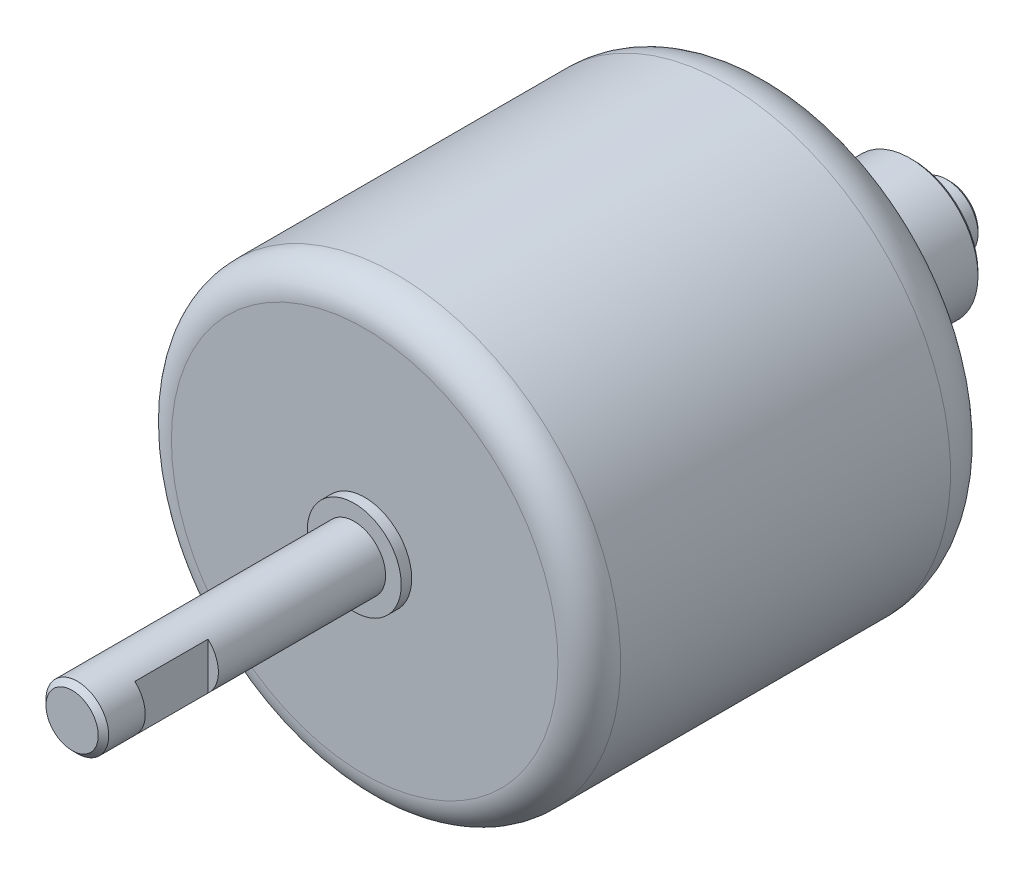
ISO-10303-21;
HEADER;
FILE_DESCRIPTION(('STEP AP214'),'2;1');
FILE_NAME('part.step','',(''),(''),'','','');
FILE_SCHEMA(('AUTOMOTIVE_DESIGN { 1 0 10303 214 1 1 1 1 }'));
ENDSEC;
DATA;
#1=APPLICATION_CONTEXT('core data for automotive mechanical design processes');
#2=APPLICATION_PROTOCOL_DEFINITION('international standard','automotive_design',2000,#1);
#3=PRODUCT_CONTEXT('',#1,'mechanical');
#4=PRODUCT('Part','Part','',(#3));
#5=PRODUCT_RELATED_PRODUCT_CATEGORY('part','',(#4));
#6=PRODUCT_DEFINITION_FORMATION('','',#4);
#7=PRODUCT_DEFINITION_CONTEXT('part definition',#1,'design');
#8=PRODUCT_DEFINITION('design','',#6,#7);
#9=PRODUCT_DEFINITION_SHAPE('','',#8);
#10=(LENGTH_UNIT() NAMED_UNIT(*) SI_UNIT(.MILLI.,.METRE.));
#11=(NAMED_UNIT(*) PLANE_ANGLE_UNIT() SI_UNIT($,.RADIAN.));
#12=(NAMED_UNIT(*) SI_UNIT($,.STERADIAN.) SOLID_ANGLE_UNIT());
#13=UNCERTAINTY_MEASURE_WITH_UNIT(LENGTH_MEASURE(1.E-05),#10,'distance_accuracy_value','');
#14=(GEOMETRIC_REPRESENTATION_CONTEXT(3) GLOBAL_UNCERTAINTY_ASSIGNED_CONTEXT((#13)) GLOBAL_UNIT_ASSIGNED_CONTEXT((#10,
#11,#12)) REPRESENTATION_CONTEXT('',''));
#15=CARTESIAN_POINT('',(0.,0.,0.));
#16=DIRECTION('',(0.,0.,1.));
#17=DIRECTION('',(1.,0.,0.));
#18=AXIS2_PLACEMENT_3D('',#15,#16,#17);
#19=CARTESIAN_POINT('',(0.,3.,0.));
#20=DIRECTION('',(0.,0.,1.));
#21=DIRECTION('',(1.,0.,0.));
#22=AXIS2_PLACEMENT_3D('',#19,#20,#21);
#23=PLANE('',#22);
#24=CARTESIAN_POINT('',(0.,0.,0.));
#25=DIRECTION('',(0.,0.,1.));
#26=DIRECTION('',(1.,0.,0.));
#27=AXIS2_PLACEMENT_3D('',#24,#25,#26);
#28=CIRCLE('',#27,2.7);
#29=CARTESIAN_POINT('',(2.7,0.,0.));
#30=VERTEX_POINT('',#29);
#31=EDGE_CURVE('E11',#30,#30,#28,.F.);
#32=ORIENTED_EDGE('',*,*,#31,.T.);
#33=EDGE_LOOP('',(#32));
#34=FACE_BOUND('',#33,.T.);
#35=ADVANCED_FACE('F35',(#34),#23,.F.);
#36=CARTESIAN_POINT('',(0.,0.,84.));
#37=DIRECTION('',(0.,0.,1.));
#38=DIRECTION('',(1.,0.,0.));
#39=AXIS2_PLACEMENT_3D('',#36,#37,#38);
#40=CYLINDRICAL_SURFACE('',#39,3.);
#41=CARTESIAN_POINT('',(0.,0.,0.299999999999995));
#42=DIRECTION('',(0.,0.,1.));
#43=DIRECTION('',(1.,0.,0.));
#44=AXIS2_PLACEMENT_3D('',#41,#42,#43);
#45=CIRCLE('',#44,3.);
#46=CARTESIAN_POINT('',(3.,0.,0.299999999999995));
#47=VERTEX_POINT('',#46);
#48=EDGE_CURVE('E42',#47,#47,#45,.T.);
#49=ORIENTED_EDGE('',*,*,#48,.T.);
#50=EDGE_LOOP('',(#49));
#51=FACE_BOUND('',#50,.T.);
#52=CARTESIAN_POINT('',(0.,0.,3.5));
#53=DIRECTION('',(0.,0.,1.));
#54=DIRECTION('',(1.,0.,0.));
#55=AXIS2_PLACEMENT_3D('',#52,#53,#54);
#56=CIRCLE('',#55,3.);
#57=CARTESIAN_POINT('',(3.,0.,3.5));
#58=VERTEX_POINT('',#57);
#59=EDGE_CURVE('E230',#58,#58,#56,.T.);
#60=ORIENTED_EDGE('',*,*,#59,.F.);
#61=EDGE_LOOP('',(#60));
#62=FACE_BOUND('',#61,.T.);
#63=ADVANCED_FACE('F122',(#51,#62),#40,.T.);
#64=CARTESIAN_POINT('',(0.,3.,3.5));
#65=DIRECTION('',(0.,0.,1.));
#66=DIRECTION('',(1.,0.,0.));
#67=AXIS2_PLACEMENT_3D('',#64,#65,#66);
#68=PLANE('',#67);
#69=CARTESIAN_POINT('',(0.,0.,3.5));
#70=DIRECTION('',(0.,0.,1.));
#71=DIRECTION('',(1.,0.,0.));
#72=AXIS2_PLACEMENT_3D('',#69,#70,#71);
#73=CIRCLE('',#72,6.19999999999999);
#74=CARTESIAN_POINT('',(6.19999999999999,0.,3.5));
#75=VERTEX_POINT('',#74);
#76=EDGE_CURVE('E117',#75,#75,#73,.F.);
#77=ORIENTED_EDGE('',*,*,#76,.T.);
#78=EDGE_LOOP('',(#77));
#79=FACE_BOUND('',#78,.T.);
#80=ORIENTED_EDGE('',*,*,#59,.T.);
#81=EDGE_LOOP('',(#80));
#82=FACE_BOUND('',#81,.T.);
#83=ADVANCED_FACE('F142',(#79,#82),#68,.F.);
#84=CARTESIAN_POINT('',(0.,0.,84.));
#85=DIRECTION('',(0.,0.,1.));
#86=DIRECTION('',(1.,0.,0.));
#87=AXIS2_PLACEMENT_3D('',#84,#85,#86);
#88=CYLINDRICAL_SURFACE('',#87,6.5);
#89=CARTESIAN_POINT('',(0.,0.,3.8));
#90=DIRECTION('',(0.,0.,1.));
#91=DIRECTION('',(1.,0.,0.));
#92=AXIS2_PLACEMENT_3D('',#89,#90,#91);
#93=CIRCLE('',#92,6.5);
#94=CARTESIAN_POINT('',(6.5,0.,3.8));
#95=VERTEX_POINT('',#94);
#96=EDGE_CURVE('E114',#95,#95,#93,.T.);
#97=ORIENTED_EDGE('',*,*,#96,.T.);
#98=EDGE_LOOP('',(#97));
#99=FACE_BOUND('',#98,.T.);
#100=CARTESIAN_POINT('',(0.,0.,14.5));
#101=DIRECTION('',(0.,0.,1.));
#102=DIRECTION('',(1.,0.,0.));
#103=AXIS2_PLACEMENT_3D('',#100,#101,#102);
#104=CIRCLE('',#103,6.5);
#105=CARTESIAN_POINT('',(6.5,0.,14.5));
#106=VERTEX_POINT('',#105);
#107=EDGE_CURVE('E226',#106,#106,#104,.T.);
#108=ORIENTED_EDGE('',*,*,#107,.F.);
#109=EDGE_LOOP('',(#108));
#110=FACE_BOUND('',#109,.T.);
#111=ADVANCED_FACE('F146',(#99,#110),#88,.T.);
#112=CARTESIAN_POINT('',(0.,6.5,14.5));
#113=DIRECTION('',(0.,0.,1.));
#114=DIRECTION('',(1.,0.,0.));
#115=AXIS2_PLACEMENT_3D('',#112,#113,#114);
#116=PLANE('',#115);
#117=CARTESIAN_POINT('',(0.,0.,14.5));
#118=DIRECTION('',(0.,0.,1.));
#119=DIRECTION('',(1.,0.,0.));
#120=AXIS2_PLACEMENT_3D('',#117,#118,#119);
#121=CIRCLE('',#120,13.1602540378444);
#122=CARTESIAN_POINT('',(13.1602540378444,0.,14.5));
#123=VERTEX_POINT('',#122);
#124=EDGE_CURVE('E102',#123,#123,#121,.F.);
#125=ORIENTED_EDGE('',*,*,#124,.T.);
#126=EDGE_LOOP('',(#125));
#127=FACE_BOUND('',#126,.T.);
#128=ORIENTED_EDGE('',*,*,#107,.T.);
#129=EDGE_LOOP('',(#128));
#130=FACE_BOUND('',#129,.T.);
#131=ADVANCED_FACE('F152',(#127,#130),#116,.F.);
#132=CARTESIAN_POINT('',(0.,0.,14.5));
#133=DIRECTION('',(0.,0.,1.));
#134=DIRECTION('',(1.,0.,0.));
#135=AXIS2_PLACEMENT_3D('',#132,#133,#134);
#136=CONICAL_SURFACE('',#135,14.5,1.0471975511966);
#137=CARTESIAN_POINT('',(0.,0.,15.1698729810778));
#138=DIRECTION('',(0.,0.,-1.));
#139=DIRECTION('',(-1.,0.,0.));
#140=AXIS2_PLACEMENT_3D('',#137,#138,#139);
#141=CIRCLE('',#140,15.6602540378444);
#142=CARTESIAN_POINT('',(-15.6602540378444,0.,15.1698729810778));
#143=VERTEX_POINT('',#142);
#144=EDGE_CURVE('E95',#143,#143,#141,.F.);
#145=ORIENTED_EDGE('',*,*,#144,.T.);
#146=EDGE_LOOP('',(#145));
#147=FACE_BOUND('',#146,.T.);
#148=CARTESIAN_POINT('',(0.,0.,17.0980762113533));
#149=DIRECTION('',(0.,0.,-1.));
#150=DIRECTION('',(-1.,0.,0.));
#151=AXIS2_PLACEMENT_3D('',#148,#149,#150);
#152=CIRCLE('',#151,19.);
#153=CARTESIAN_POINT('',(-19.,0.,17.0980762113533));
#154=VERTEX_POINT('',#153);
#155=EDGE_CURVE('E92',#154,#154,#152,.T.);
#156=ORIENTED_EDGE('',*,*,#155,.T.);
#157=EDGE_LOOP('',(#156));
#158=FACE_BOUND('',#157,.T.);
#159=ADVANCED_FACE('F156',(#147,#158),#136,.T.);
#160=CARTESIAN_POINT('',(0.,0.,84.));
#161=DIRECTION('',(0.,0.,1.));
#162=DIRECTION('',(1.,0.,0.));
#163=AXIS2_PLACEMENT_3D('',#160,#161,#162);
#164=CYLINDRICAL_SURFACE('',#163,21.5);
#165=CARTESIAN_POINT('',(0.,0.,53.));
#166=DIRECTION('',(0.,0.,-1.));
#167=DIRECTION('',(-1.,0.,0.));
#168=AXIS2_PLACEMENT_3D('',#165,#166,#167);
#169=CIRCLE('',#168,21.5);
#170=CARTESIAN_POINT('',(-21.5,0.,53.));
#171=VERTEX_POINT('',#170);
#172=EDGE_CURVE('E111',#171,#171,#169,.T.);
#173=ORIENTED_EDGE('',*,*,#172,.T.);
#174=EDGE_LOOP('',(#173));
#175=FACE_BOUND('',#174,.T.);
#176=CARTESIAN_POINT('',(0.,0.,21.4282032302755));
#177=DIRECTION('',(0.,0.,-1.));
#178=DIRECTION('',(-1.,0.,0.));
#179=AXIS2_PLACEMENT_3D('',#176,#177,#178);
#180=CIRCLE('',#179,21.5);
#181=CARTESIAN_POINT('',(-21.5,0.,21.4282032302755));
#182=VERTEX_POINT('',#181);
#183=EDGE_CURVE('E105',#182,#182,#180,.F.);
#184=ORIENTED_EDGE('',*,*,#183,.T.);
#185=EDGE_LOOP('',(#184));
#186=FACE_BOUND('',#185,.T.);
#187=ADVANCED_FACE('F160',(#175,#186),#164,.T.);
#188=CARTESIAN_POINT('',(0.,4.5,56.));
#189=DIRECTION('',(0.,0.,-1.));
#190=DIRECTION('',(-1.,0.,0.));
#191=AXIS2_PLACEMENT_3D('',#188,#189,#190);
#192=PLANE('',#191);
#193=CARTESIAN_POINT('',(0.,0.,56.));
#194=DIRECTION('',(0.,0.,-1.));
#195=DIRECTION('',(-1.,0.,0.));
#196=AXIS2_PLACEMENT_3D('',#193,#194,#195);
#197=CIRCLE('',#196,18.5);
#198=CARTESIAN_POINT('',(-18.5,0.,56.));
#199=VERTEX_POINT('',#198);
#200=EDGE_CURVE('E108',#199,#199,#197,.F.);
#201=ORIENTED_EDGE('',*,*,#200,.T.);
#202=EDGE_LOOP('',(#201));
#203=FACE_BOUND('',#202,.T.);
#204=CARTESIAN_POINT('',(0.,0.,56.));
#205=DIRECTION('',(0.,0.,1.));
#206=DIRECTION('',(1.,0.,0.));
#207=AXIS2_PLACEMENT_3D('',#204,#205,#206);
#208=CIRCLE('',#207,4.5);
#209=CARTESIAN_POINT('',(4.5,0.,56.));
#210=VERTEX_POINT('',#209);
#211=EDGE_CURVE('E224',#210,#210,#208,.T.);
#212=ORIENTED_EDGE('',*,*,#211,.F.);
#213=EDGE_LOOP('',(#212));
#214=FACE_BOUND('',#213,.T.);
#215=ADVANCED_FACE('F164',(#203,#214),#192,.F.);
#216=CARTESIAN_POINT('',(0.,0.,84.));
#217=DIRECTION('',(0.,0.,1.));
#218=DIRECTION('',(1.,0.,0.));
#219=AXIS2_PLACEMENT_3D('',#216,#217,#218);
#220=CYLINDRICAL_SURFACE('',#219,4.5);
#221=CARTESIAN_POINT('',(0.,0.,57.));
#222=DIRECTION('',(0.,0.,1.));
#223=DIRECTION('',(1.,0.,0.));
#224=AXIS2_PLACEMENT_3D('',#221,#222,#223);
#225=CIRCLE('',#224,4.5);
#226=CARTESIAN_POINT('',(4.5,0.,57.));
#227=VERTEX_POINT('',#226);
#228=EDGE_CURVE('E227',#227,#227,#225,.T.);
#229=ORIENTED_EDGE('',*,*,#228,.F.);
#230=EDGE_LOOP('',(#229));
#231=FACE_BOUND('',#230,.T.);
#232=ORIENTED_EDGE('',*,*,#211,.T.);
#233=EDGE_LOOP('',(#232));
#234=FACE_BOUND('',#233,.T.);
#235=ADVANCED_FACE('F168',(#231,#234),#220,.T.);
#236=CARTESIAN_POINT('',(0.,4.5,57.));
#237=DIRECTION('',(0.,0.,-1.));
#238=DIRECTION('',(-1.,0.,0.));
#239=AXIS2_PLACEMENT_3D('',#236,#237,#238);
#240=PLANE('',#239);
#241=CARTESIAN_POINT('',(0.,0.,57.));
#242=DIRECTION('',(0.,0.,1.));
#243=DIRECTION('',(1.,0.,0.));
#244=AXIS2_PLACEMENT_3D('',#241,#242,#243);
#245=CIRCLE('',#244,2.99999999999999);
#246=CARTESIAN_POINT('',(2.99999999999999,0.,57.));
#247=VERTEX_POINT('',#246);
#248=EDGE_CURVE('E233',#247,#247,#245,.T.);
#249=ORIENTED_EDGE('',*,*,#248,.F.);
#250=EDGE_LOOP('',(#249));
#251=FACE_BOUND('',#250,.T.);
#252=ORIENTED_EDGE('',*,*,#228,.T.);
#253=EDGE_LOOP('',(#252));
#254=FACE_BOUND('',#253,.T.);
#255=ADVANCED_FACE('F172',(#251,#254),#240,.F.);
#256=CARTESIAN_POINT('',(0.,0.,84.));
#257=DIRECTION('',(0.,0.,1.));
#258=DIRECTION('',(1.,0.,0.));
#259=AXIS2_PLACEMENT_3D('',#256,#257,#258);
#260=CYLINDRICAL_SURFACE('',#259,2.99999999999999);
#261=CARTESIAN_POINT('',(0.,0.,73.));
#262=DIRECTION('',(0.,0.,-1.));
#263=DIRECTION('',(-1.,0.,0.));
#264=AXIS2_PLACEMENT_3D('',#261,#262,#263);
#265=CIRCLE('',#264,2.99999999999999);
#266=CARTESIAN_POINT('',(-2.,-2.23606797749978,73.));
#267=VERTEX_POINT('',#266);
#268=CARTESIAN_POINT('',(-2.,2.23606797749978,73.));
#269=VERTEX_POINT('',#268);
#270=EDGE_CURVE('E91',#267,#269,#265,.T.);
#271=ORIENTED_EDGE('',*,*,#270,.T.);
#272=DIRECTION('',(0.,0.,1.));
#273=VECTOR('',#272,1.);
#274=CARTESIAN_POINT('',(-2.,2.23606797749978,84.));
#275=LINE('',#274,#273);
#276=CARTESIAN_POINT('',(-2.,2.23606797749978,80.));
#277=VERTEX_POINT('',#276);
#278=EDGE_CURVE('E85',#269,#277,#275,.T.);
#279=ORIENTED_EDGE('',*,*,#278,.T.);
#280=CARTESIAN_POINT('',(0.,0.,80.));
#281=DIRECTION('',(0.,0.,1.));
#282=DIRECTION('',(1.,0.,0.));
#283=AXIS2_PLACEMENT_3D('',#280,#281,#282);
#284=CIRCLE('',#283,2.99999999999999);
#285=CARTESIAN_POINT('',(-2.,-2.23606797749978,80.));
#286=VERTEX_POINT('',#285);
#287=EDGE_CURVE('E73',#277,#286,#284,.T.);
#288=ORIENTED_EDGE('',*,*,#287,.T.);
#289=DIRECTION('',(0.,0.,1.));
#290=VECTOR('',#289,1.);
#291=CARTESIAN_POINT('',(-2.,-2.23606797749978,84.));
#292=LINE('',#291,#290);
#293=EDGE_CURVE('E78',#286,#267,#292,.F.);
#294=ORIENTED_EDGE('',*,*,#293,.T.);
#295=EDGE_LOOP('',(#271,#279,#288,#294));
#296=FACE_BOUND('',#295,.T.);
#297=CARTESIAN_POINT('',(0.,0.,73.));
#298=DIRECTION('',(0.,0.,-1.));
#299=DIRECTION('',(-1.,0.,0.));
#300=AXIS2_PLACEMENT_3D('',#297,#298,#299);
#301=CIRCLE('',#300,2.99999999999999);
#302=CARTESIAN_POINT('',(1.99999999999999,2.23606797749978,73.));
#303=VERTEX_POINT('',#302);
#304=CARTESIAN_POINT('',(1.99999999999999,-2.23606797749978,73.));
#305=VERTEX_POINT('',#304);
#306=EDGE_CURVE('E55',#303,#305,#301,.T.);
#307=ORIENTED_EDGE('',*,*,#306,.T.);
#308=DIRECTION('',(0.,0.,1.));
#309=VECTOR('',#308,1.);
#310=CARTESIAN_POINT('',(1.99999999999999,-2.23606797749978,84.));
#311=LINE('',#310,#309);
#312=CARTESIAN_POINT('',(1.99999999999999,-2.23606797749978,80.));
#313=VERTEX_POINT('',#312);
#314=EDGE_CURVE('E79',#305,#313,#311,.T.);
#315=ORIENTED_EDGE('',*,*,#314,.T.);
#316=CARTESIAN_POINT('',(0.,0.,80.));
#317=DIRECTION('',(0.,0.,1.));
#318=DIRECTION('',(1.,0.,0.));
#319=AXIS2_PLACEMENT_3D('',#316,#317,#318);
#320=CIRCLE('',#319,2.99999999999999);
#321=CARTESIAN_POINT('',(1.99999999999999,2.23606797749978,80.));
#322=VERTEX_POINT('',#321);
#323=EDGE_CURVE('E245',#313,#322,#320,.T.);
#324=ORIENTED_EDGE('',*,*,#323,.T.);
#325=DIRECTION('',(0.,0.,1.));
#326=VECTOR('',#325,1.);
#327=CARTESIAN_POINT('',(1.99999999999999,2.23606797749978,84.));
#328=LINE('',#327,#326);
#329=EDGE_CURVE('E247',#322,#303,#328,.F.);
#330=ORIENTED_EDGE('',*,*,#329,.T.);
#331=EDGE_LOOP('',(#307,#315,#324,#330));
#332=FACE_BOUND('',#331,.T.);
#333=CARTESIAN_POINT('',(0.,0.,83.5));
#334=DIRECTION('',(0.,0.,-1.));
#335=DIRECTION('',(-1.,0.,0.));
#336=AXIS2_PLACEMENT_3D('',#333,#334,#335);
#337=CIRCLE('',#336,2.99999999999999);
#338=CARTESIAN_POINT('',(-2.99999999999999,0.,83.5));
#339=VERTEX_POINT('',#338);
#340=EDGE_CURVE('E242',#339,#339,#337,.T.);
#341=ORIENTED_EDGE('',*,*,#340,.T.);
#342=EDGE_LOOP('',(#341));
#343=FACE_BOUND('',#342,.T.);
#344=ORIENTED_EDGE('',*,*,#248,.T.);
#345=EDGE_LOOP('',(#344));
#346=FACE_BOUND('',#345,.T.);
#347=ADVANCED_FACE('F89',(#296,#332,#343,#346),#260,.T.);
#348=CARTESIAN_POINT('',(0.,2.99999999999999,84.));
#349=DIRECTION('',(0.,0.,-1.));
#350=DIRECTION('',(-1.,0.,0.));
#351=AXIS2_PLACEMENT_3D('',#348,#349,#350);
#352=PLANE('',#351);
#353=CARTESIAN_POINT('',(0.,0.,84.));
#354=DIRECTION('',(0.,0.,-1.));
#355=DIRECTION('',(-1.,0.,0.));
#356=AXIS2_PLACEMENT_3D('',#353,#354,#355);
#357=CIRCLE('',#356,2.49999999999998);
#358=CARTESIAN_POINT('',(-2.49999999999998,0.,84.));
#359=VERTEX_POINT('',#358);
#360=EDGE_CURVE('E239',#359,#359,#357,.F.);
#361=ORIENTED_EDGE('',*,*,#360,.T.);
#362=EDGE_LOOP('',(#361));
#363=FACE_BOUND('',#362,.T.);
#364=ADVANCED_FACE('F179',(#363),#352,.F.);
#365=CARTESIAN_POINT('',(0.,0.,84.));
#366=DIRECTION('',(0.,0.,-1.));
#367=DIRECTION('',(-1.,0.,0.));
#368=AXIS2_PLACEMENT_3D('',#365,#366,#367);
#369=CONICAL_SURFACE('',#368,2.49999999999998,0.785398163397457);
#370=ORIENTED_EDGE('',*,*,#340,.F.);
#371=EDGE_LOOP('',(#370));
#372=FACE_BOUND('',#371,.T.);
#373=ORIENTED_EDGE('',*,*,#360,.F.);
#374=EDGE_LOOP('',(#373));
#375=FACE_BOUND('',#374,.T.);
#376=ADVANCED_FACE('F182',(#372,#375),#369,.T.);
#377=CARTESIAN_POINT('',(1.99999999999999,-5.,73.));
#378=DIRECTION('',(0.,0.,-1.));
#379=DIRECTION('',(-1.,0.,0.));
#380=AXIS2_PLACEMENT_3D('',#377,#378,#379);
#381=PLANE('',#380);
#382=DIRECTION('',(0.,1.,0.));
#383=VECTOR('',#382,1.);
#384=CARTESIAN_POINT('',(1.99999999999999,-5.,73.));
#385=LINE('',#384,#383);
#386=EDGE_CURVE('E256',#305,#303,#385,.T.);
#387=ORIENTED_EDGE('',*,*,#386,.F.);
#388=ORIENTED_EDGE('',*,*,#306,.F.);
#389=EDGE_LOOP('',(#387,#388));
#390=FACE_BOUND('',#389,.T.);
#391=ADVANCED_FACE('F186',(#390),#381,.F.);
#392=CARTESIAN_POINT('',(1.99999999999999,-5.,73.));
#393=DIRECTION('',(-1.,0.,0.));
#394=DIRECTION('',(0.,0.,1.));
#395=AXIS2_PLACEMENT_3D('',#392,#393,#394);
#396=PLANE('',#395);
#397=ORIENTED_EDGE('',*,*,#386,.T.);
#398=ORIENTED_EDGE('',*,*,#329,.F.);
#399=DIRECTION('',(0.,1.,0.));
#400=VECTOR('',#399,1.);
#401=CARTESIAN_POINT('',(1.99999999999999,-5.,80.));
#402=LINE('',#401,#400);
#403=EDGE_CURVE('E258',#313,#322,#402,.T.);
#404=ORIENTED_EDGE('',*,*,#403,.F.);
#405=ORIENTED_EDGE('',*,*,#314,.F.);
#406=EDGE_LOOP('',(#397,#398,#404,#405));
#407=FACE_BOUND('',#406,.T.);
#408=ADVANCED_FACE('F188',(#407),#396,.F.);
#409=CARTESIAN_POINT('',(1.99999999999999,-5.,80.));
#410=DIRECTION('',(0.,0.,1.));
#411=DIRECTION('',(1.,0.,0.));
#412=AXIS2_PLACEMENT_3D('',#409,#410,#411);
#413=PLANE('',#412);
#414=ORIENTED_EDGE('',*,*,#323,.F.);
#415=ORIENTED_EDGE('',*,*,#403,.T.);
#416=EDGE_LOOP('',(#414,#415));
#417=FACE_BOUND('',#416,.T.);
#418=ADVANCED_FACE('F191',(#417),#413,.F.);
#419=CARTESIAN_POINT('',(-2.99999999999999,-5.,73.));
#420=DIRECTION('',(0.,0.,-1.));
#421=DIRECTION('',(-1.,0.,0.));
#422=AXIS2_PLACEMENT_3D('',#419,#420,#421);
#423=PLANE('',#422);
#424=ORIENTED_EDGE('',*,*,#270,.F.);
#425=DIRECTION('',(0.,1.,0.));
#426=VECTOR('',#425,1.);
#427=CARTESIAN_POINT('',(-2.,-5.,73.));
#428=LINE('',#427,#426);
#429=EDGE_CURVE('E87',#267,#269,#428,.T.);
#430=ORIENTED_EDGE('',*,*,#429,.T.);
#431=EDGE_LOOP('',(#424,#430));
#432=FACE_BOUND('',#431,.T.);
#433=ADVANCED_FACE('F195',(#432),#423,.F.);
#434=CARTESIAN_POINT('',(-2.,-5.,73.));
#435=DIRECTION('',(1.,0.,0.));
#436=DIRECTION('',(0.,0.,-1.));
#437=AXIS2_PLACEMENT_3D('',#434,#435,#436);
#438=PLANE('',#437);
#439=ORIENTED_EDGE('',*,*,#429,.F.);
#440=ORIENTED_EDGE('',*,*,#293,.F.);
#441=DIRECTION('',(0.,1.,0.));
#442=VECTOR('',#441,1.);
#443=CARTESIAN_POINT('',(-2.,-5.,80.));
#444=LINE('',#443,#442);
#445=EDGE_CURVE('E48',#286,#277,#444,.T.);
#446=ORIENTED_EDGE('',*,*,#445,.T.);
#447=ORIENTED_EDGE('',*,*,#278,.F.);
#448=EDGE_LOOP('',(#439,#440,#446,#447));
#449=FACE_BOUND('',#448,.T.);
#450=ADVANCED_FACE('F84',(#449),#438,.F.);
#451=CARTESIAN_POINT('',(-2.99999999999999,-5.,80.));
#452=DIRECTION('',(0.,0.,1.));
#453=DIRECTION('',(1.,0.,0.));
#454=AXIS2_PLACEMENT_3D('',#451,#452,#453);
#455=PLANE('',#454);
#456=ORIENTED_EDGE('',*,*,#445,.F.);
#457=ORIENTED_EDGE('',*,*,#287,.F.);
#458=EDGE_LOOP('',(#456,#457));
#459=FACE_BOUND('',#458,.T.);
#460=ADVANCED_FACE('F74',(#459),#455,.F.);
#461=CARTESIAN_POINT('',(0.,0.,19.5));
#462=DIRECTION('',(0.,0.,1.));
#463=DIRECTION('',(1.,0.,0.));
#464=AXIS2_PLACEMENT_3D('',#461,#462,#463);
#465=TOROIDAL_SURFACE('',#464,13.1602540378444,5.);
#466=ORIENTED_EDGE('',*,*,#124,.F.);
#467=EDGE_LOOP('',(#466));
#468=FACE_BOUND('',#467,.T.);
#469=ORIENTED_EDGE('',*,*,#144,.F.);
#470=EDGE_LOOP('',(#469));
#471=FACE_BOUND('',#470,.T.);
#472=ADVANCED_FACE('F201',(#468,#471),#465,.T.);
#473=CARTESIAN_POINT('',(0.,0.,21.4282032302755));
#474=DIRECTION('',(0.,0.,-1.));
#475=DIRECTION('',(-1.,0.,0.));
#476=AXIS2_PLACEMENT_3D('',#473,#474,#475);
#477=TOROIDAL_SURFACE('',#476,16.5,5.);
#478=ORIENTED_EDGE('',*,*,#155,.F.);
#479=EDGE_LOOP('',(#478));
#480=FACE_BOUND('',#479,.T.);
#481=ORIENTED_EDGE('',*,*,#183,.F.);
#482=EDGE_LOOP('',(#481));
#483=FACE_BOUND('',#482,.T.);
#484=ADVANCED_FACE('F209',(#480,#483),#477,.T.);
#485=CARTESIAN_POINT('',(0.,0.,53.));
#486=DIRECTION('',(0.,0.,-1.));
#487=DIRECTION('',(-1.,0.,0.));
#488=AXIS2_PLACEMENT_3D('',#485,#486,#487);
#489=TOROIDAL_SURFACE('',#488,18.5,3.);
#490=ORIENTED_EDGE('',*,*,#172,.F.);
#491=EDGE_LOOP('',(#490));
#492=FACE_BOUND('',#491,.T.);
#493=ORIENTED_EDGE('',*,*,#200,.F.);
#494=EDGE_LOOP('',(#493));
#495=FACE_BOUND('',#494,.T.);
#496=ADVANCED_FACE('F133',(#492,#495),#489,.T.);
#497=CARTESIAN_POINT('',(0.,0.,3.8));
#498=DIRECTION('',(0.,0.,1.));
#499=DIRECTION('',(1.,0.,0.));
#500=AXIS2_PLACEMENT_3D('',#497,#498,#499);
#501=CONICAL_SURFACE('',#500,6.5,0.785398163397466);
#502=ORIENTED_EDGE('',*,*,#76,.F.);
#503=EDGE_LOOP('',(#502));
#504=FACE_BOUND('',#503,.T.);
#505=ORIENTED_EDGE('',*,*,#96,.F.);
#506=EDGE_LOOP('',(#505));
#507=FACE_BOUND('',#506,.T.);
#508=ADVANCED_FACE('F127',(#504,#507),#501,.T.);
#509=CARTESIAN_POINT('',(0.,0.,0.299999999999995));
#510=DIRECTION('',(0.,0.,1.));
#511=DIRECTION('',(1.,0.,0.));
#512=AXIS2_PLACEMENT_3D('',#509,#510,#511);
#513=CONICAL_SURFACE('',#512,3.,0.785398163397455);
#514=ORIENTED_EDGE('',*,*,#31,.F.);
#515=EDGE_LOOP('',(#514));
#516=FACE_BOUND('',#515,.T.);
#517=ORIENTED_EDGE('',*,*,#48,.F.);
#518=EDGE_LOOP('',(#517));
#519=FACE_BOUND('',#518,.T.);
#520=ADVANCED_FACE('F125',(#516,#519),#513,.T.);
#521=CLOSED_SHELL('',(#35,#63,#83,#111,#131,#159,#187,#215,#235,#255,#347,#364,#376,#391,#408,
#418,#433,#450,#460,#472,#484,#496,#508,#520));
#522=MANIFOLD_SOLID_BREP('B2',#521);
#523=ADVANCED_BREP_SHAPE_REPRESENTATION('',(#18,#522),#14);
#524=SHAPE_DEFINITION_REPRESENTATION(#9,#523);
ENDSEC;
END-ISO-10303-21;
